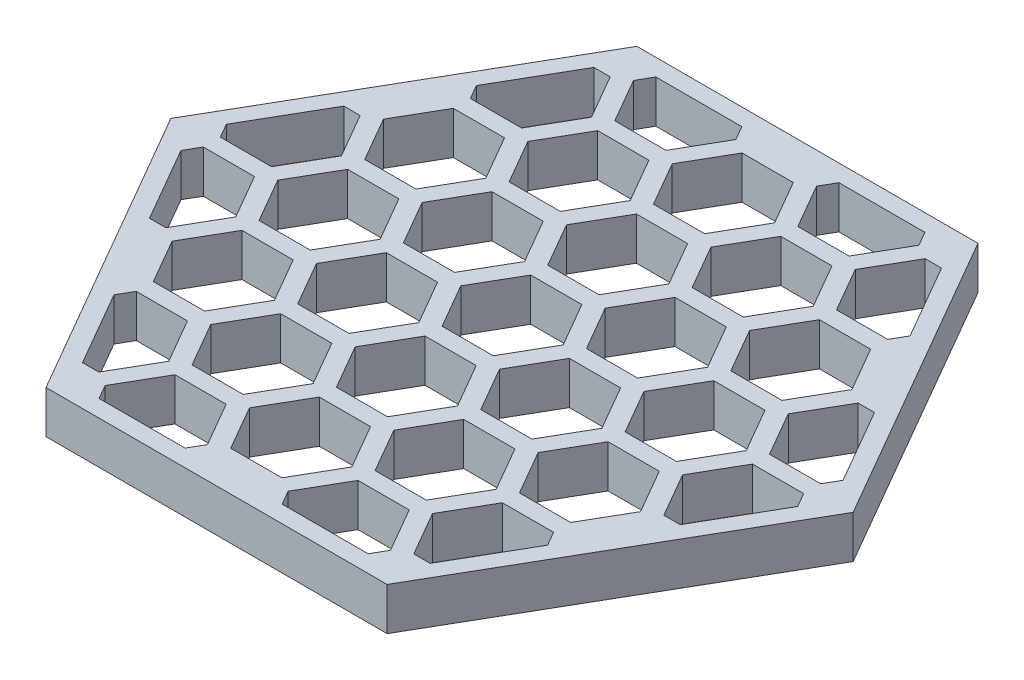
from build123d import *

# Parameters (mm, degrees)
SALIENTE_EXTRUIR1_DEPTH = 5


with BuildPart() as part:
    # Croquis1 → Saliente-Extruir1 (new body)
    with BuildSketch(Plane(origin=(0, 0, 0), x_dir=(1, 0, 0), z_dir=(0, 1, 0))):
        Polygon((-20, 34.641016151), (-40, 0), (-20, -34.641016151), (20, -34.641016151), (40, 0), (20, 34.641016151), align=None)
        Polygon((-25.422649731, -21.248711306), (-24.464101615, -19.588457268), (-18.464101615, -19.588457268), (-15.464101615, -24.784609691), (-18.464101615, -29.980762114), (-20.381197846, -29.980762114), align=None, mode=Mode.SUBTRACT)
        Polygon((-15.773502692, -32.641016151), (-16.732050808, -30.980762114), (-13.732050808, -25.784609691), (-7.732050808, -25.784609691), (-4.732050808, -30.980762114), (-5.690598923, -32.641016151), align=None, mode=Mode.SUBTRACT)
        Polygon((3, -29.980762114), (-3, -29.980762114), (-6, -24.784609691), (-3, -19.588457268), (3, -19.588457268), (6, -24.784609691), align=None, mode=Mode.SUBTRACT)
        Polygon((-13.732050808, -23.784609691), (-16.732050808, -18.588457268), (-13.732050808, -13.392304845), (-7.732050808, -13.392304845), (-4.732050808, -18.588457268), (-7.732050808, -23.784609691), align=None, mode=Mode.SUBTRACT)
        Polygon((-24.464101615, -17.588457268), (-27.464101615, -12.392304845), (-24.464101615, -7.196152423), (-18.464101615, -7.196152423), (-15.464101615, -12.392304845), (-18.464101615, -17.588457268), align=None, mode=Mode.SUBTRACT)
        Polygon((-31.113248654, -11.392304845), (-36.154700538, -2.660254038), (-35.196152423, -1), (-29.196152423, -1), (-26.196152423, -6.196152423), (-29.196152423, -11.392304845), align=None, mode=Mode.SUBTRACT)
        Polygon((3, -17.588457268), (-3, -17.588457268), (-6, -12.392304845), (-3, -7.196152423), (3, -7.196152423), (6, -12.392304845), align=None, mode=Mode.SUBTRACT)
        Polygon((-13.732050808, -11.392304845), (-16.732050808, -6.196152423), (-13.732050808, -1), (-7.732050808, -1), (-4.732050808, -6.196152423), (-7.732050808, -11.392304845), align=None, mode=Mode.SUBTRACT)
        Polygon((5.690598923, -32.641016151), (4.732050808, -30.980762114), (7.732050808, -25.784609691), (13.732050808, -25.784609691), (16.732050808, -30.980762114), (15.773502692, -32.641016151), align=None, mode=Mode.SUBTRACT)
        Polygon((13.732050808, -23.784609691), (7.732050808, -23.784609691), (4.732050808, -18.588457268), (7.732050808, -13.392304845), (13.732050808, -13.392304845), (16.732050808, -18.588457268), align=None, mode=Mode.SUBTRACT)
        Polygon((20.381197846, -29.980762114), (18.464101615, -29.980762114), (15.464101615, -24.784609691), (18.464101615, -19.588457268), (24.464101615, -19.588457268), (25.422649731, -21.248711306), align=None, mode=Mode.SUBTRACT)
        Polygon((3, 5.196152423), (6, 0), (3, -5.196152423), (-3, -5.196152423), (-6, 0), (-3, 5.196152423), align=None, mode=Mode.SUBTRACT)
        Polygon((16.732050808, -6.196152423), (13.732050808, -11.392304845), (7.732050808, -11.392304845), (4.732050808, -6.196152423), (7.732050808, -1), (13.732050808, -1), align=None, mode=Mode.SUBTRACT)
        Polygon((27.464101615, -12.392304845), (24.464101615, -17.588457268), (18.464101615, -17.588457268), (15.464101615, -12.392304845), (18.464101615, -7.196152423), (24.464101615, -7.196152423), align=None, mode=Mode.SUBTRACT)
        Polygon((27.464101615, 0), (24.464101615, -5.196152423), (18.464101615, -5.196152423), (15.464101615, 0), (18.464101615, 5.196152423), (24.464101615, 5.196152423), align=None, mode=Mode.SUBTRACT)
        Polygon((31.113248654, -11.392304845), (29.196152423, -11.392304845), (26.196152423, -6.196152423), (29.196152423, -1), (35.196152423, -1), (36.154700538, -2.660254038), align=None, mode=Mode.SUBTRACT)
        Polygon((-36.154700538, 2.660254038), (-31.113248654, 11.392304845), (-29.196152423, 11.392304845), (-26.196152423, 6.196152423), (-29.196152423, 1), (-35.196152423, 1), align=None, mode=Mode.SUBTRACT)
        Polygon((-27.464101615, 0), (-24.464101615, 5.196152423), (-18.464101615, 5.196152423), (-15.464101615, 0), (-18.464101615, -5.196152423), (-24.464101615, -5.196152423), align=None, mode=Mode.SUBTRACT)
        Polygon((-27.464101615, 12.392304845), (-24.464101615, 17.588457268), (-18.464101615, 17.588457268), (-15.464101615, 12.392304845), (-18.464101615, 7.196152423), (-24.464101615, 7.196152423), align=None, mode=Mode.SUBTRACT)
        Polygon((-16.732050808, 6.196152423), (-13.732050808, 11.392304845), (-7.732050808, 11.392304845), (-4.732050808, 6.196152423), (-7.732050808, 1), (-13.732050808, 1), align=None, mode=Mode.SUBTRACT)
        Polygon((-25.422649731, 21.248711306), (-20.381197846, 29.980762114), (-18.464101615, 29.980762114), (-15.464101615, 24.784609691), (-18.464101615, 19.588457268), (-24.464101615, 19.588457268), align=None, mode=Mode.SUBTRACT)
        Polygon((-13.732050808, 23.784609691), (-7.732050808, 23.784609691), (-4.732050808, 18.588457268), (-7.732050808, 13.392304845), (-13.732050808, 13.392304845), (-16.732050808, 18.588457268), align=None, mode=Mode.SUBTRACT)
        Polygon((-15.773502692, 32.641016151), (-5.690598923, 32.641016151), (-4.732050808, 30.980762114), (-7.732050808, 25.784609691), (-13.732050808, 25.784609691), (-16.732050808, 30.980762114), align=None, mode=Mode.SUBTRACT)
        Polygon((13.732050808, 11.392304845), (16.732050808, 6.196152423), (13.732050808, 1), (7.732050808, 1), (4.732050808, 6.196152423), (7.732050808, 11.392304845), align=None, mode=Mode.SUBTRACT)
        Polygon((-3, 17.588457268), (3, 17.588457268), (6, 12.392304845), (3, 7.196152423), (-3, 7.196152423), (-6, 12.392304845), align=None, mode=Mode.SUBTRACT)
        Polygon((31.113248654, 11.392304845), (36.154700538, 2.660254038), (35.196152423, 1), (29.196152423, 1), (26.196152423, 6.196152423), (29.196152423, 11.392304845), align=None, mode=Mode.SUBTRACT)
        Polygon((24.464101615, 7.196152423), (18.464101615, 7.196152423), (15.464101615, 12.392304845), (18.464101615, 17.588457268), (24.464101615, 17.588457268), (27.464101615, 12.392304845), align=None, mode=Mode.SUBTRACT)
        Polygon((13.732050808, 23.784609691), (16.732050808, 18.588457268), (13.732050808, 13.392304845), (7.732050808, 13.392304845), (4.732050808, 18.588457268), (7.732050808, 23.784609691), align=None, mode=Mode.SUBTRACT)
        Polygon((3, 29.980762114), (6, 24.784609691), (3, 19.588457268), (-3, 19.588457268), (-6, 24.784609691), (-3, 29.980762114), align=None, mode=Mode.SUBTRACT)
        Polygon((5.690598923, 32.641016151), (15.773502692, 32.641016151), (16.732050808, 30.980762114), (13.732050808, 25.784609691), (7.732050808, 25.784609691), (4.732050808, 30.980762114), align=None, mode=Mode.SUBTRACT)
        Polygon((20.381197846, 29.980762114), (25.422649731, 21.248711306), (24.464101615, 19.588457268), (18.464101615, 19.588457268), (15.464101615, 24.784609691), (18.464101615, 29.980762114), align=None, mode=Mode.SUBTRACT)
    extrude(amount=SALIENTE_EXTRUIR1_DEPTH)


solid = part.part
